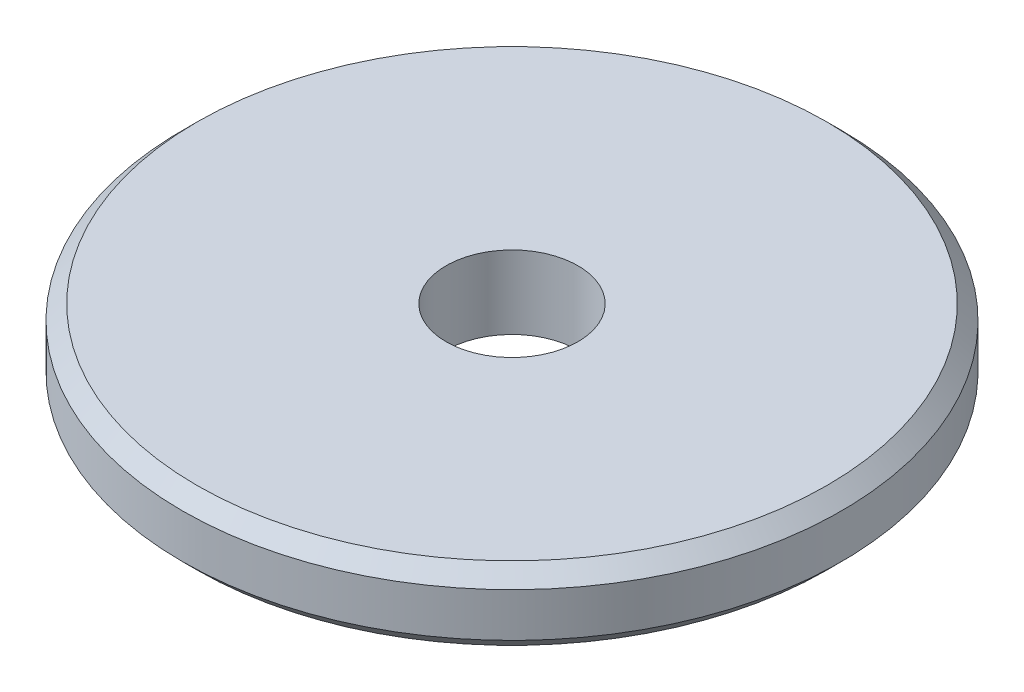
ISO-10303-21;
HEADER;
FILE_DESCRIPTION(('STEP AP214'),'2;1');
FILE_NAME('part.step','',(''),(''),'','','');
FILE_SCHEMA(('AUTOMOTIVE_DESIGN { 1 0 10303 214 1 1 1 1 }'));
ENDSEC;
DATA;
#1=APPLICATION_CONTEXT('core data for automotive mechanical design processes');
#2=APPLICATION_PROTOCOL_DEFINITION('international standard','automotive_design',2000,#1);
#3=PRODUCT_CONTEXT('',#1,'mechanical');
#4=PRODUCT('Part','Part','',(#3));
#5=PRODUCT_RELATED_PRODUCT_CATEGORY('part','',(#4));
#6=PRODUCT_DEFINITION_FORMATION('','',#4);
#7=PRODUCT_DEFINITION_CONTEXT('part definition',#1,'design');
#8=PRODUCT_DEFINITION('design','',#6,#7);
#9=PRODUCT_DEFINITION_SHAPE('','',#8);
#10=(LENGTH_UNIT() NAMED_UNIT(*) SI_UNIT(.MILLI.,.METRE.));
#11=(NAMED_UNIT(*) PLANE_ANGLE_UNIT() SI_UNIT($,.RADIAN.));
#12=(NAMED_UNIT(*) SI_UNIT($,.STERADIAN.) SOLID_ANGLE_UNIT());
#13=UNCERTAINTY_MEASURE_WITH_UNIT(LENGTH_MEASURE(1.E-05),#10,'distance_accuracy_value','');
#14=(GEOMETRIC_REPRESENTATION_CONTEXT(3) GLOBAL_UNCERTAINTY_ASSIGNED_CONTEXT((#13)) GLOBAL_UNIT_ASSIGNED_CONTEXT((#10,
#11,#12)) REPRESENTATION_CONTEXT('',''));
#15=CARTESIAN_POINT('',(0.,0.,0.));
#16=DIRECTION('',(0.,0.,1.));
#17=DIRECTION('',(1.,0.,0.));
#18=AXIS2_PLACEMENT_3D('',#15,#16,#17);
#19=CARTESIAN_POINT('',(0.,5.,0.));
#20=DIRECTION('',(0.,1.,0.));
#21=DIRECTION('',(0.,0.,1.));
#22=AXIS2_PLACEMENT_3D('',#19,#20,#21);
#23=PLANE('',#22);
#24=CARTESIAN_POINT('',(0.,5.,0.));
#25=DIRECTION('',(0.,1.,0.));
#26=DIRECTION('',(0.,0.,1.));
#27=AXIS2_PLACEMENT_3D('',#24,#25,#26);
#28=CIRCLE('',#27,21.5);
#29=CARTESIAN_POINT('',(0.,5.,21.5));
#30=VERTEX_POINT('',#29);
#31=EDGE_CURVE('E10',#30,#30,#28,.T.);
#32=ORIENTED_EDGE('',*,*,#31,.T.);
#33=EDGE_LOOP('',(#32));
#34=FACE_BOUND('',#33,.T.);
#35=CARTESIAN_POINT('',(0.,5.,0.));
#36=DIRECTION('',(0.,1.,0.));
#37=DIRECTION('',(0.,0.,1.));
#38=AXIS2_PLACEMENT_3D('',#35,#36,#37);
#39=CIRCLE('',#38,4.5);
#40=CARTESIAN_POINT('',(0.,5.,4.5));
#41=VERTEX_POINT('',#40);
#42=EDGE_CURVE('E49',#41,#41,#39,.T.);
#43=ORIENTED_EDGE('',*,*,#42,.F.);
#44=EDGE_LOOP('',(#43));
#45=FACE_BOUND('',#44,.T.);
#46=ADVANCED_FACE('F29',(#34,#45),#23,.T.);
#47=CARTESIAN_POINT('',(0.,0.,0.));
#48=DIRECTION('',(0.,1.,0.));
#49=DIRECTION('',(0.,0.,1.));
#50=AXIS2_PLACEMENT_3D('',#47,#48,#49);
#51=PLANE('',#50);
#52=CARTESIAN_POINT('',(0.,0.,0.));
#53=DIRECTION('',(0.,1.,0.));
#54=DIRECTION('',(0.,0.,1.));
#55=AXIS2_PLACEMENT_3D('',#52,#53,#54);
#56=CIRCLE('',#55,21.5);
#57=CARTESIAN_POINT('',(0.,0.,21.5));
#58=VERTEX_POINT('',#57);
#59=EDGE_CURVE('E36',#58,#58,#56,.F.);
#60=ORIENTED_EDGE('',*,*,#59,.T.);
#61=EDGE_LOOP('',(#60));
#62=FACE_BOUND('',#61,.T.);
#63=CARTESIAN_POINT('',(0.,0.,0.));
#64=DIRECTION('',(0.,1.,0.));
#65=DIRECTION('',(0.,0.,1.));
#66=AXIS2_PLACEMENT_3D('',#63,#64,#65);
#67=CIRCLE('',#66,4.5);
#68=CARTESIAN_POINT('',(0.,0.,4.5));
#69=VERTEX_POINT('',#68);
#70=EDGE_CURVE('E50',#69,#69,#67,.T.);
#71=ORIENTED_EDGE('',*,*,#70,.T.);
#72=EDGE_LOOP('',(#71));
#73=FACE_BOUND('',#72,.T.);
#74=ADVANCED_FACE('F60',(#62,#73),#51,.F.);
#75=CARTESIAN_POINT('',(0.,5.,0.));
#76=DIRECTION('',(0.,-1.,0.));
#77=DIRECTION('',(0.,0.,-1.));
#78=AXIS2_PLACEMENT_3D('',#75,#76,#77);
#79=CYLINDRICAL_SURFACE('',#78,22.5);
#80=CARTESIAN_POINT('',(0.,1.00000000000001,0.));
#81=DIRECTION('',(0.,1.,0.));
#82=DIRECTION('',(0.,0.,1.));
#83=AXIS2_PLACEMENT_3D('',#80,#81,#82);
#84=CIRCLE('',#83,22.5);
#85=CARTESIAN_POINT('',(0.,1.00000000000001,22.5));
#86=VERTEX_POINT('',#85);
#87=EDGE_CURVE('E40',#86,#86,#84,.T.);
#88=ORIENTED_EDGE('',*,*,#87,.T.);
#89=EDGE_LOOP('',(#88));
#90=FACE_BOUND('',#89,.T.);
#91=CARTESIAN_POINT('',(0.,4.00000000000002,0.));
#92=DIRECTION('',(0.,1.,0.));
#93=DIRECTION('',(0.,0.,1.));
#94=AXIS2_PLACEMENT_3D('',#91,#92,#93);
#95=CIRCLE('',#94,22.5);
#96=CARTESIAN_POINT('',(0.,4.00000000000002,22.5));
#97=VERTEX_POINT('',#96);
#98=EDGE_CURVE('E44',#97,#97,#95,.F.);
#99=ORIENTED_EDGE('',*,*,#98,.T.);
#100=EDGE_LOOP('',(#99));
#101=FACE_BOUND('',#100,.T.);
#102=ADVANCED_FACE('F65',(#90,#101),#79,.T.);
#103=CARTESIAN_POINT('',(0.,5.,0.));
#104=DIRECTION('',(0.,-1.,0.));
#105=DIRECTION('',(0.,0.,-1.));
#106=AXIS2_PLACEMENT_3D('',#103,#104,#105);
#107=CYLINDRICAL_SURFACE('',#106,4.5);
#108=ORIENTED_EDGE('',*,*,#42,.T.);
#109=EDGE_LOOP('',(#108));
#110=FACE_BOUND('',#109,.T.);
#111=ORIENTED_EDGE('',*,*,#70,.F.);
#112=EDGE_LOOP('',(#111));
#113=FACE_BOUND('',#112,.T.);
#114=ADVANCED_FACE('F56',(#110,#113),#107,.F.);
#115=CARTESIAN_POINT('',(0.,1.00000000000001,0.));
#116=DIRECTION('',(0.,1.,0.));
#117=DIRECTION('',(0.,0.,1.));
#118=AXIS2_PLACEMENT_3D('',#115,#116,#117);
#119=CONICAL_SURFACE('',#118,22.5,0.785398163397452);
#120=ORIENTED_EDGE('',*,*,#59,.F.);
#121=EDGE_LOOP('',(#120));
#122=FACE_BOUND('',#121,.T.);
#123=ORIENTED_EDGE('',*,*,#87,.F.);
#124=EDGE_LOOP('',(#123));
#125=FACE_BOUND('',#124,.T.);
#126=ADVANCED_FACE('F71',(#122,#125),#119,.T.);
#127=CARTESIAN_POINT('',(0.,5.,0.));
#128=DIRECTION('',(0.,-1.,0.));
#129=DIRECTION('',(0.,0.,-1.));
#130=AXIS2_PLACEMENT_3D('',#127,#128,#129);
#131=CONICAL_SURFACE('',#130,21.5,0.785398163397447);
#132=ORIENTED_EDGE('',*,*,#98,.F.);
#133=EDGE_LOOP('',(#132));
#134=FACE_BOUND('',#133,.T.);
#135=ORIENTED_EDGE('',*,*,#31,.F.);
#136=EDGE_LOOP('',(#135));
#137=FACE_BOUND('',#136,.T.);
#138=ADVANCED_FACE('F31',(#134,#137),#131,.T.);
#139=CLOSED_SHELL('',(#46,#74,#102,#114,#126,#138));
#140=MANIFOLD_SOLID_BREP('B2',#139);
#141=ADVANCED_BREP_SHAPE_REPRESENTATION('',(#18,#140),#14);
#142=SHAPE_DEFINITION_REPRESENTATION(#9,#141);
ENDSEC;
END-ISO-10303-21;
